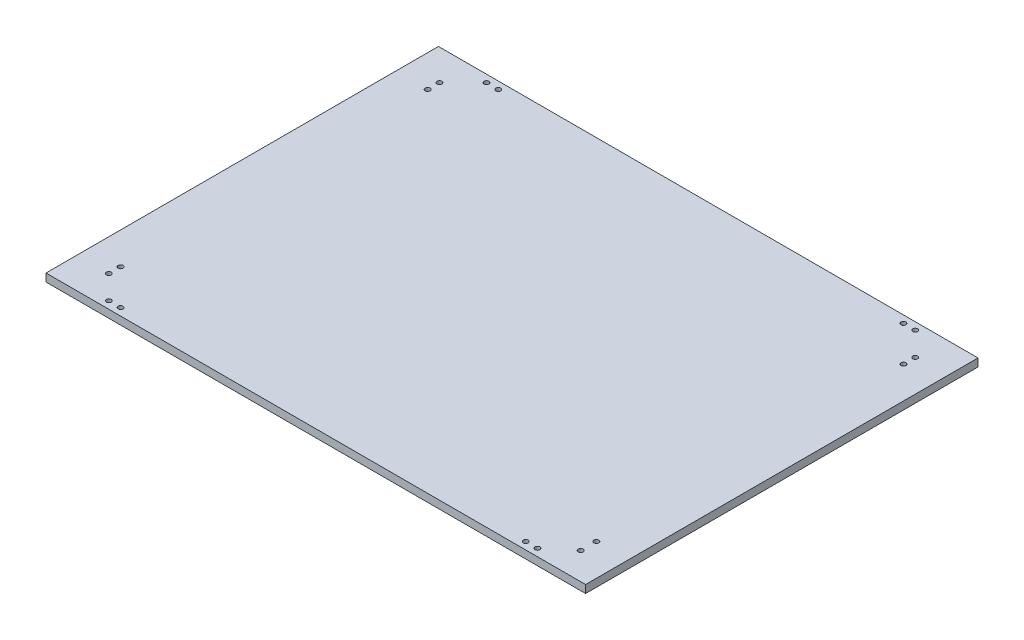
ISO-10303-21;
HEADER;
FILE_DESCRIPTION(('STEP AP214'),'2;1');
FILE_NAME('part.step','',(''),(''),'','','');
FILE_SCHEMA(('AUTOMOTIVE_DESIGN { 1 0 10303 214 1 1 1 1 }'));
ENDSEC;
DATA;
#1=APPLICATION_CONTEXT('core data for automotive mechanical design processes');
#2=APPLICATION_PROTOCOL_DEFINITION('international standard','automotive_design',2000,#1);
#3=PRODUCT_CONTEXT('',#1,'mechanical');
#4=PRODUCT('Part','Part','',(#3));
#5=PRODUCT_RELATED_PRODUCT_CATEGORY('part','',(#4));
#6=PRODUCT_DEFINITION_FORMATION('','',#4);
#7=PRODUCT_DEFINITION_CONTEXT('part definition',#1,'design');
#8=PRODUCT_DEFINITION('design','',#6,#7);
#9=PRODUCT_DEFINITION_SHAPE('','',#8);
#10=(LENGTH_UNIT() NAMED_UNIT(*) SI_UNIT(.MILLI.,.METRE.));
#11=(NAMED_UNIT(*) PLANE_ANGLE_UNIT() SI_UNIT($,.RADIAN.));
#12=(NAMED_UNIT(*) SI_UNIT($,.STERADIAN.) SOLID_ANGLE_UNIT());
#13=UNCERTAINTY_MEASURE_WITH_UNIT(LENGTH_MEASURE(1.E-05),#10,'distance_accuracy_value','');
#14=(GEOMETRIC_REPRESENTATION_CONTEXT(3) GLOBAL_UNCERTAINTY_ASSIGNED_CONTEXT((#13)) GLOBAL_UNIT_ASSIGNED_CONTEXT((#10,
#11,#12)) REPRESENTATION_CONTEXT('',''));
#15=CARTESIAN_POINT('',(0.,0.,0.));
#16=DIRECTION('',(0.,0.,1.));
#17=DIRECTION('',(1.,0.,0.));
#18=AXIS2_PLACEMENT_3D('',#15,#16,#17);
#19=CARTESIAN_POINT('',(0.,16.,0.));
#20=DIRECTION('',(1.,0.,0.));
#21=DIRECTION('',(0.,0.,-1.));
#22=AXIS2_PLACEMENT_3D('',#19,#20,#21);
#23=PLANE('',#22);
#24=DIRECTION('',(0.,0.,1.));
#25=VECTOR('',#24,1.);
#26=CARTESIAN_POINT('',(0.,0.,0.));
#27=LINE('',#26,#25);
#28=CARTESIAN_POINT('',(-1.9593701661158E-13,0.,-800.));
#29=VERTEX_POINT('',#28);
#30=CARTESIAN_POINT('',(0.,0.,0.));
#31=VERTEX_POINT('',#30);
#32=EDGE_CURVE('E70',#29,#31,#27,.T.);
#33=ORIENTED_EDGE('',*,*,#32,.T.);
#34=DIRECTION('',(0.,-1.,0.));
#35=VECTOR('',#34,1.);
#36=CARTESIAN_POINT('',(0.,16.,0.));
#37=LINE('',#36,#35);
#38=CARTESIAN_POINT('',(0.,16.,0.));
#39=VERTEX_POINT('',#38);
#40=EDGE_CURVE('E11',#39,#31,#37,.T.);
#41=ORIENTED_EDGE('',*,*,#40,.F.);
#42=DIRECTION('',(0.,0.,1.));
#43=VECTOR('',#42,1.);
#44=CARTESIAN_POINT('',(0.,16.,0.));
#45=LINE('',#44,#43);
#46=CARTESIAN_POINT('',(-1.9593701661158E-13,16.,-800.));
#47=VERTEX_POINT('',#46);
#48=EDGE_CURVE('E93',#47,#39,#45,.T.);
#49=ORIENTED_EDGE('',*,*,#48,.F.);
#50=DIRECTION('',(0.,-1.,0.));
#51=VECTOR('',#50,1.);
#52=CARTESIAN_POINT('',(-1.9593701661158E-13,16.,-800.));
#53=LINE('',#52,#51);
#54=EDGE_CURVE('E82',#47,#29,#53,.T.);
#55=ORIENTED_EDGE('',*,*,#54,.T.);
#56=EDGE_LOOP('',(#33,#41,#49,#55));
#57=FACE_BOUND('',#56,.T.);
#58=ADVANCED_FACE('F26',(#57),#23,.F.);
#59=CARTESIAN_POINT('',(0.,16.,0.));
#60=DIRECTION('',(0.,0.,-1.));
#61=DIRECTION('',(-1.,0.,0.));
#62=AXIS2_PLACEMENT_3D('',#59,#60,#61);
#63=PLANE('',#62);
#64=DIRECTION('',(1.,0.,0.));
#65=VECTOR('',#64,1.);
#66=CARTESIAN_POINT('',(0.,0.,0.));
#67=LINE('',#66,#65);
#68=CARTESIAN_POINT('',(1100.,0.,0.));
#69=VERTEX_POINT('',#68);
#70=EDGE_CURVE('E66',#31,#69,#67,.T.);
#71=ORIENTED_EDGE('',*,*,#70,.T.);
#72=DIRECTION('',(0.,-1.,0.));
#73=VECTOR('',#72,1.);
#74=CARTESIAN_POINT('',(1100.,16.,0.));
#75=LINE('',#74,#73);
#76=CARTESIAN_POINT('',(1100.,16.,0.));
#77=VERTEX_POINT('',#76);
#78=EDGE_CURVE('E33',#77,#69,#75,.T.);
#79=ORIENTED_EDGE('',*,*,#78,.F.);
#80=DIRECTION('',(1.,0.,0.));
#81=VECTOR('',#80,1.);
#82=CARTESIAN_POINT('',(0.,16.,0.));
#83=LINE('',#82,#81);
#84=EDGE_CURVE('E78',#39,#77,#83,.T.);
#85=ORIENTED_EDGE('',*,*,#84,.F.);
#86=ORIENTED_EDGE('',*,*,#40,.T.);
#87=EDGE_LOOP('',(#71,#79,#85,#86));
#88=FACE_BOUND('',#87,.T.);
#89=ADVANCED_FACE('F77',(#88),#63,.F.);
#90=CARTESIAN_POINT('',(1100.,16.,0.));
#91=DIRECTION('',(-1.,0.,0.));
#92=DIRECTION('',(0.,0.,1.));
#93=AXIS2_PLACEMENT_3D('',#90,#91,#92);
#94=PLANE('',#93);
#95=DIRECTION('',(0.,0.,-1.));
#96=VECTOR('',#95,1.);
#97=CARTESIAN_POINT('',(1100.,0.,0.));
#98=LINE('',#97,#96);
#99=CARTESIAN_POINT('',(1100.,0.,-800.));
#100=VERTEX_POINT('',#99);
#101=EDGE_CURVE('E71',#69,#100,#98,.T.);
#102=ORIENTED_EDGE('',*,*,#101,.T.);
#103=DIRECTION('',(0.,-1.,0.));
#104=VECTOR('',#103,1.);
#105=CARTESIAN_POINT('',(1100.,16.,-800.));
#106=LINE('',#105,#104);
#107=CARTESIAN_POINT('',(1100.,16.,-800.));
#108=VERTEX_POINT('',#107);
#109=EDGE_CURVE('E99',#108,#100,#106,.T.);
#110=ORIENTED_EDGE('',*,*,#109,.F.);
#111=DIRECTION('',(0.,0.,-1.));
#112=VECTOR('',#111,1.);
#113=CARTESIAN_POINT('',(1100.,16.,0.));
#114=LINE('',#113,#112);
#115=EDGE_CURVE('E45',#77,#108,#114,.T.);
#116=ORIENTED_EDGE('',*,*,#115,.F.);
#117=ORIENTED_EDGE('',*,*,#78,.T.);
#118=EDGE_LOOP('',(#102,#110,#116,#117));
#119=FACE_BOUND('',#118,.T.);
#120=ADVANCED_FACE('F102',(#119),#94,.F.);
#121=CARTESIAN_POINT('',(-1.9593701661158E-13,16.,-800.));
#122=DIRECTION('',(0.,0.,1.));
#123=DIRECTION('',(1.,0.,0.));
#124=AXIS2_PLACEMENT_3D('',#121,#122,#123);
#125=PLANE('',#124);
#126=DIRECTION('',(-1.,0.,0.));
#127=VECTOR('',#126,1.);
#128=CARTESIAN_POINT('',(-1.9593701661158E-13,0.,-800.));
#129=LINE('',#128,#127);
#130=EDGE_CURVE('E91',#100,#29,#129,.T.);
#131=ORIENTED_EDGE('',*,*,#130,.T.);
#132=ORIENTED_EDGE('',*,*,#54,.F.);
#133=DIRECTION('',(-1.,0.,0.));
#134=VECTOR('',#133,1.);
#135=CARTESIAN_POINT('',(-1.9593701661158E-13,16.,-800.));
#136=LINE('',#135,#134);
#137=EDGE_CURVE('E40',#108,#47,#136,.T.);
#138=ORIENTED_EDGE('',*,*,#137,.F.);
#139=ORIENTED_EDGE('',*,*,#109,.T.);
#140=EDGE_LOOP('',(#131,#132,#138,#139));
#141=FACE_BOUND('',#140,.T.);
#142=ADVANCED_FACE('F104',(#141),#125,.F.);
#143=CARTESIAN_POINT('',(-1.9593701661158E-13,16.,-800.));
#144=DIRECTION('',(0.,-1.,0.));
#145=DIRECTION('',(0.,0.,-1.));
#146=AXIS2_PLACEMENT_3D('',#143,#144,#145);
#147=PLANE('',#146);
#148=CARTESIAN_POINT('',(987.,16.,-785.));
#149=DIRECTION('',(0.,1.,0.));
#150=DIRECTION('',(0.,0.,-1.));
#151=AXIS2_PLACEMENT_3D('',#148,#149,#150);
#152=CIRCLE('',#151,5.00000000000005);
#153=CARTESIAN_POINT('',(987.,16.,-790.));
#154=VERTEX_POINT('',#153);
#155=EDGE_CURVE('E273',#154,#154,#152,.T.);
#156=ORIENTED_EDGE('',*,*,#155,.F.);
#157=EDGE_LOOP('',(#156));
#158=FACE_BOUND('',#157,.T.);
#159=CARTESIAN_POINT('',(64.9999999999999,16.,-87.));
#160=DIRECTION('',(0.,1.,0.));
#161=DIRECTION('',(0.,0.,1.));
#162=AXIS2_PLACEMENT_3D('',#159,#160,#161);
#163=CIRCLE('',#162,5.00000000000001);
#164=CARTESIAN_POINT('',(64.9999999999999,16.,-82.));
#165=VERTEX_POINT('',#164);
#166=EDGE_CURVE('E275',#165,#165,#163,.T.);
#167=ORIENTED_EDGE('',*,*,#166,.F.);
#168=EDGE_LOOP('',(#167));
#169=FACE_BOUND('',#168,.T.);
#170=CARTESIAN_POINT('',(963.,16.,-785.));
#171=DIRECTION('',(0.,1.,0.));
#172=DIRECTION('',(0.,0.,1.));
#173=AXIS2_PLACEMENT_3D('',#170,#171,#172);
#174=CIRCLE('',#173,4.99999999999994);
#175=CARTESIAN_POINT('',(963.,16.,-780.));
#176=VERTEX_POINT('',#175);
#177=EDGE_CURVE('E283',#176,#176,#174,.T.);
#178=ORIENTED_EDGE('',*,*,#177,.F.);
#179=EDGE_LOOP('',(#178));
#180=FACE_BOUND('',#179,.T.);
#181=CARTESIAN_POINT('',(963.,16.,-15.));
#182=DIRECTION('',(0.,1.,0.));
#183=DIRECTION('',(0.,0.,-1.));
#184=AXIS2_PLACEMENT_3D('',#181,#182,#183);
#185=CIRCLE('',#184,5.00000000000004);
#186=CARTESIAN_POINT('',(963.,16.,-20.0000000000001));
#187=VERTEX_POINT('',#186);
#188=EDGE_CURVE('E289',#187,#187,#185,.T.);
#189=ORIENTED_EDGE('',*,*,#188,.F.);
#190=EDGE_LOOP('',(#189));
#191=FACE_BOUND('',#190,.T.);
#192=CARTESIAN_POINT('',(987.,16.,-15.));
#193=DIRECTION('',(0.,1.,0.));
#194=DIRECTION('',(0.,0.,1.));
#195=AXIS2_PLACEMENT_3D('',#192,#193,#194);
#196=CIRCLE('',#195,4.99999999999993);
#197=CARTESIAN_POINT('',(987.,16.,-10.0000000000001));
#198=VERTEX_POINT('',#197);
#199=EDGE_CURVE('E295',#198,#198,#196,.T.);
#200=ORIENTED_EDGE('',*,*,#199,.F.);
#201=EDGE_LOOP('',(#200));
#202=FACE_BOUND('',#201,.T.);
#203=CARTESIAN_POINT('',(113.,16.,-15.));
#204=DIRECTION('',(0.,1.,0.));
#205=DIRECTION('',(0.,0.,-1.));
#206=AXIS2_PLACEMENT_3D('',#203,#204,#205);
#207=CIRCLE('',#206,4.99999999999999);
#208=CARTESIAN_POINT('',(113.,16.,-20.));
#209=VERTEX_POINT('',#208);
#210=EDGE_CURVE('E301',#209,#209,#207,.T.);
#211=ORIENTED_EDGE('',*,*,#210,.F.);
#212=EDGE_LOOP('',(#211));
#213=FACE_BOUND('',#212,.T.);
#214=CARTESIAN_POINT('',(64.9999999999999,16.,-63.0000000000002));
#215=DIRECTION('',(0.,1.,0.));
#216=DIRECTION('',(0.,0.,-1.));
#217=AXIS2_PLACEMENT_3D('',#214,#215,#216);
#218=CIRCLE('',#217,5.00000000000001);
#219=CARTESIAN_POINT('',(64.9999999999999,16.,-68.0000000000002));
#220=VERTEX_POINT('',#219);
#221=EDGE_CURVE('E307',#220,#220,#218,.T.);
#222=ORIENTED_EDGE('',*,*,#221,.F.);
#223=EDGE_LOOP('',(#222));
#224=FACE_BOUND('',#223,.T.);
#225=CARTESIAN_POINT('',(137.,16.,-15.));
#226=DIRECTION('',(0.,1.,0.));
#227=DIRECTION('',(0.,0.,1.));
#228=AXIS2_PLACEMENT_3D('',#225,#226,#227);
#229=CIRCLE('',#228,5.00000000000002);
#230=CARTESIAN_POINT('',(137.,16.,-9.99999999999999));
#231=VERTEX_POINT('',#230);
#232=EDGE_CURVE('E313',#231,#231,#229,.T.);
#233=ORIENTED_EDGE('',*,*,#232,.F.);
#234=EDGE_LOOP('',(#233));
#235=FACE_BOUND('',#234,.T.);
#236=CARTESIAN_POINT('',(64.9999999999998,16.,-737.));
#237=DIRECTION('',(0.,1.,0.));
#238=DIRECTION('',(0.,0.,1.));
#239=AXIS2_PLACEMENT_3D('',#236,#237,#238);
#240=CIRCLE('',#239,5.00000000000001);
#241=CARTESIAN_POINT('',(64.9999999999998,16.,-732.));
#242=VERTEX_POINT('',#241);
#243=EDGE_CURVE('E319',#242,#242,#240,.T.);
#244=ORIENTED_EDGE('',*,*,#243,.F.);
#245=EDGE_LOOP('',(#244));
#246=FACE_BOUND('',#245,.T.);
#247=CARTESIAN_POINT('',(137.,16.,-785.));
#248=DIRECTION('',(0.,1.,0.));
#249=DIRECTION('',(0.,0.,-1.));
#250=AXIS2_PLACEMENT_3D('',#247,#248,#249);
#251=CIRCLE('',#250,4.99999999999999);
#252=CARTESIAN_POINT('',(137.,16.,-790.));
#253=VERTEX_POINT('',#252);
#254=EDGE_CURVE('E325',#253,#253,#251,.T.);
#255=ORIENTED_EDGE('',*,*,#254,.F.);
#256=EDGE_LOOP('',(#255));
#257=FACE_BOUND('',#256,.T.);
#258=CARTESIAN_POINT('',(1035.,16.,-713.));
#259=DIRECTION('',(0.,1.,0.));
#260=DIRECTION('',(0.,0.,1.));
#261=AXIS2_PLACEMENT_3D('',#258,#259,#260);
#262=CIRCLE('',#261,5.00000000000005);
#263=CARTESIAN_POINT('',(1035.,16.,-708.));
#264=VERTEX_POINT('',#263);
#265=EDGE_CURVE('E331',#264,#264,#262,.T.);
#266=ORIENTED_EDGE('',*,*,#265,.F.);
#267=EDGE_LOOP('',(#266));
#268=FACE_BOUND('',#267,.T.);
#269=CARTESIAN_POINT('',(1035.,16.,-737.));
#270=DIRECTION('',(0.,1.,0.));
#271=DIRECTION('',(0.,0.,-1.));
#272=AXIS2_PLACEMENT_3D('',#269,#270,#271);
#273=CIRCLE('',#272,5.00000000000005);
#274=CARTESIAN_POINT('',(1035.,16.,-742.));
#275=VERTEX_POINT('',#274);
#276=EDGE_CURVE('E337',#275,#275,#273,.T.);
#277=ORIENTED_EDGE('',*,*,#276,.F.);
#278=EDGE_LOOP('',(#277));
#279=FACE_BOUND('',#278,.T.);
#280=CARTESIAN_POINT('',(1035.,16.,-54.9999999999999));
#281=DIRECTION('',(0.,1.,0.));
#282=DIRECTION('',(0.,0.,1.));
#283=AXIS2_PLACEMENT_3D('',#280,#281,#282);
#284=CIRCLE('',#283,5.00000000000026);
#285=CARTESIAN_POINT('',(1035.,16.,-49.9999999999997));
#286=VERTEX_POINT('',#285);
#287=EDGE_CURVE('E343',#286,#286,#284,.T.);
#288=ORIENTED_EDGE('',*,*,#287,.F.);
#289=EDGE_LOOP('',(#288));
#290=FACE_BOUND('',#289,.T.);
#291=CARTESIAN_POINT('',(1035.,16.,-87.));
#292=DIRECTION('',(0.,1.,0.));
#293=DIRECTION('',(0.,0.,-1.));
#294=AXIS2_PLACEMENT_3D('',#291,#292,#293);
#295=CIRCLE('',#294,5.00000000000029);
#296=CARTESIAN_POINT('',(1035.,16.,-92.0000000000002));
#297=VERTEX_POINT('',#296);
#298=EDGE_CURVE('E349',#297,#297,#295,.T.);
#299=ORIENTED_EDGE('',*,*,#298,.F.);
#300=EDGE_LOOP('',(#299));
#301=FACE_BOUND('',#300,.T.);
#302=CARTESIAN_POINT('',(64.9999999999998,16.,-713.));
#303=DIRECTION('',(0.,1.,0.));
#304=DIRECTION('',(0.,0.,-1.));
#305=AXIS2_PLACEMENT_3D('',#302,#303,#304);
#306=CIRCLE('',#305,5.00000000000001);
#307=CARTESIAN_POINT('',(64.9999999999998,16.,-718.));
#308=VERTEX_POINT('',#307);
#309=EDGE_CURVE('E355',#308,#308,#306,.T.);
#310=ORIENTED_EDGE('',*,*,#309,.F.);
#311=EDGE_LOOP('',(#310));
#312=FACE_BOUND('',#311,.T.);
#313=CARTESIAN_POINT('',(113.,16.,-785.));
#314=DIRECTION('',(0.,1.,0.));
#315=DIRECTION('',(0.,0.,1.));
#316=AXIS2_PLACEMENT_3D('',#313,#314,#315);
#317=CIRCLE('',#316,4.99999999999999);
#318=CARTESIAN_POINT('',(113.,16.,-780.));
#319=VERTEX_POINT('',#318);
#320=EDGE_CURVE('E86',#319,#319,#317,.T.);
#321=ORIENTED_EDGE('',*,*,#320,.F.);
#322=EDGE_LOOP('',(#321));
#323=FACE_BOUND('',#322,.T.);
#324=ORIENTED_EDGE('',*,*,#48,.T.);
#325=ORIENTED_EDGE('',*,*,#84,.T.);
#326=ORIENTED_EDGE('',*,*,#115,.T.);
#327=ORIENTED_EDGE('',*,*,#137,.T.);
#328=EDGE_LOOP('',(#324,#325,#326,#327));
#329=FACE_BOUND('',#328,.T.);
#330=ADVANCED_FACE('F105',(#158,#169,#180,#191,#202,#213,#224,#235,#246,#257,#268,#279,#290,
#301,#312,#323,#329),#147,.F.);
#331=CARTESIAN_POINT('',(-1.9593701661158E-13,0.,-800.));
#332=DIRECTION('',(0.,-1.,0.));
#333=DIRECTION('',(0.,0.,-1.));
#334=AXIS2_PLACEMENT_3D('',#331,#332,#333);
#335=PLANE('',#334);
#336=CARTESIAN_POINT('',(987.,0.,-785.));
#337=DIRECTION('',(0.,1.,0.));
#338=DIRECTION('',(0.,0.,-1.));
#339=AXIS2_PLACEMENT_3D('',#336,#337,#338);
#340=CIRCLE('',#339,5.00000000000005);
#341=CARTESIAN_POINT('',(987.,0.,-790.));
#342=VERTEX_POINT('',#341);
#343=EDGE_CURVE('E271',#342,#342,#340,.T.);
#344=ORIENTED_EDGE('',*,*,#343,.T.);
#345=EDGE_LOOP('',(#344));
#346=FACE_BOUND('',#345,.T.);
#347=CARTESIAN_POINT('',(64.9999999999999,0.,-87.));
#348=DIRECTION('',(0.,1.,0.));
#349=DIRECTION('',(0.,0.,1.));
#350=AXIS2_PLACEMENT_3D('',#347,#348,#349);
#351=CIRCLE('',#350,5.00000000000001);
#352=CARTESIAN_POINT('',(64.9999999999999,0.,-82.));
#353=VERTEX_POINT('',#352);
#354=EDGE_CURVE('E280',#353,#353,#351,.T.);
#355=ORIENTED_EDGE('',*,*,#354,.T.);
#356=EDGE_LOOP('',(#355));
#357=FACE_BOUND('',#356,.T.);
#358=CARTESIAN_POINT('',(963.,0.,-785.));
#359=DIRECTION('',(0.,1.,0.));
#360=DIRECTION('',(0.,0.,1.));
#361=AXIS2_PLACEMENT_3D('',#358,#359,#360);
#362=CIRCLE('',#361,4.99999999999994);
#363=CARTESIAN_POINT('',(963.,0.,-780.));
#364=VERTEX_POINT('',#363);
#365=EDGE_CURVE('E286',#364,#364,#362,.T.);
#366=ORIENTED_EDGE('',*,*,#365,.T.);
#367=EDGE_LOOP('',(#366));
#368=FACE_BOUND('',#367,.T.);
#369=CARTESIAN_POINT('',(963.,0.,-15.));
#370=DIRECTION('',(0.,1.,0.));
#371=DIRECTION('',(0.,0.,-1.));
#372=AXIS2_PLACEMENT_3D('',#369,#370,#371);
#373=CIRCLE('',#372,5.00000000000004);
#374=CARTESIAN_POINT('',(963.,0.,-20.0000000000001));
#375=VERTEX_POINT('',#374);
#376=EDGE_CURVE('E292',#375,#375,#373,.T.);
#377=ORIENTED_EDGE('',*,*,#376,.T.);
#378=EDGE_LOOP('',(#377));
#379=FACE_BOUND('',#378,.T.);
#380=CARTESIAN_POINT('',(987.,0.,-15.));
#381=DIRECTION('',(0.,1.,0.));
#382=DIRECTION('',(0.,0.,1.));
#383=AXIS2_PLACEMENT_3D('',#380,#381,#382);
#384=CIRCLE('',#383,4.99999999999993);
#385=CARTESIAN_POINT('',(987.,0.,-10.0000000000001));
#386=VERTEX_POINT('',#385);
#387=EDGE_CURVE('E298',#386,#386,#384,.T.);
#388=ORIENTED_EDGE('',*,*,#387,.T.);
#389=EDGE_LOOP('',(#388));
#390=FACE_BOUND('',#389,.T.);
#391=CARTESIAN_POINT('',(113.,0.,-15.));
#392=DIRECTION('',(0.,1.,0.));
#393=DIRECTION('',(0.,0.,-1.));
#394=AXIS2_PLACEMENT_3D('',#391,#392,#393);
#395=CIRCLE('',#394,4.99999999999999);
#396=CARTESIAN_POINT('',(113.,0.,-20.));
#397=VERTEX_POINT('',#396);
#398=EDGE_CURVE('E304',#397,#397,#395,.T.);
#399=ORIENTED_EDGE('',*,*,#398,.T.);
#400=EDGE_LOOP('',(#399));
#401=FACE_BOUND('',#400,.T.);
#402=CARTESIAN_POINT('',(64.9999999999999,0.,-63.0000000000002));
#403=DIRECTION('',(0.,1.,0.));
#404=DIRECTION('',(0.,0.,-1.));
#405=AXIS2_PLACEMENT_3D('',#402,#403,#404);
#406=CIRCLE('',#405,5.00000000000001);
#407=CARTESIAN_POINT('',(64.9999999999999,0.,-68.0000000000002));
#408=VERTEX_POINT('',#407);
#409=EDGE_CURVE('E310',#408,#408,#406,.T.);
#410=ORIENTED_EDGE('',*,*,#409,.T.);
#411=EDGE_LOOP('',(#410));
#412=FACE_BOUND('',#411,.T.);
#413=CARTESIAN_POINT('',(137.,0.,-15.));
#414=DIRECTION('',(0.,1.,0.));
#415=DIRECTION('',(0.,0.,1.));
#416=AXIS2_PLACEMENT_3D('',#413,#414,#415);
#417=CIRCLE('',#416,5.00000000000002);
#418=CARTESIAN_POINT('',(137.,0.,-9.99999999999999));
#419=VERTEX_POINT('',#418);
#420=EDGE_CURVE('E316',#419,#419,#417,.T.);
#421=ORIENTED_EDGE('',*,*,#420,.T.);
#422=EDGE_LOOP('',(#421));
#423=FACE_BOUND('',#422,.T.);
#424=CARTESIAN_POINT('',(64.9999999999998,0.,-737.));
#425=DIRECTION('',(0.,1.,0.));
#426=DIRECTION('',(0.,0.,1.));
#427=AXIS2_PLACEMENT_3D('',#424,#425,#426);
#428=CIRCLE('',#427,5.00000000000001);
#429=CARTESIAN_POINT('',(64.9999999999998,0.,-732.));
#430=VERTEX_POINT('',#429);
#431=EDGE_CURVE('E322',#430,#430,#428,.T.);
#432=ORIENTED_EDGE('',*,*,#431,.T.);
#433=EDGE_LOOP('',(#432));
#434=FACE_BOUND('',#433,.T.);
#435=CARTESIAN_POINT('',(137.,0.,-785.));
#436=DIRECTION('',(0.,1.,0.));
#437=DIRECTION('',(0.,0.,-1.));
#438=AXIS2_PLACEMENT_3D('',#435,#436,#437);
#439=CIRCLE('',#438,4.99999999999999);
#440=CARTESIAN_POINT('',(137.,0.,-790.));
#441=VERTEX_POINT('',#440);
#442=EDGE_CURVE('E328',#441,#441,#439,.T.);
#443=ORIENTED_EDGE('',*,*,#442,.T.);
#444=EDGE_LOOP('',(#443));
#445=FACE_BOUND('',#444,.T.);
#446=CARTESIAN_POINT('',(1035.,0.,-713.));
#447=DIRECTION('',(0.,1.,0.));
#448=DIRECTION('',(0.,0.,1.));
#449=AXIS2_PLACEMENT_3D('',#446,#447,#448);
#450=CIRCLE('',#449,5.00000000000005);
#451=CARTESIAN_POINT('',(1035.,0.,-708.));
#452=VERTEX_POINT('',#451);
#453=EDGE_CURVE('E334',#452,#452,#450,.T.);
#454=ORIENTED_EDGE('',*,*,#453,.T.);
#455=EDGE_LOOP('',(#454));
#456=FACE_BOUND('',#455,.T.);
#457=CARTESIAN_POINT('',(1035.,0.,-737.));
#458=DIRECTION('',(0.,1.,0.));
#459=DIRECTION('',(0.,0.,-1.));
#460=AXIS2_PLACEMENT_3D('',#457,#458,#459);
#461=CIRCLE('',#460,5.00000000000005);
#462=CARTESIAN_POINT('',(1035.,0.,-742.));
#463=VERTEX_POINT('',#462);
#464=EDGE_CURVE('E340',#463,#463,#461,.T.);
#465=ORIENTED_EDGE('',*,*,#464,.T.);
#466=EDGE_LOOP('',(#465));
#467=FACE_BOUND('',#466,.T.);
#468=CARTESIAN_POINT('',(1035.,0.,-54.9999999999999));
#469=DIRECTION('',(0.,1.,0.));
#470=DIRECTION('',(0.,0.,1.));
#471=AXIS2_PLACEMENT_3D('',#468,#469,#470);
#472=CIRCLE('',#471,5.00000000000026);
#473=CARTESIAN_POINT('',(1035.,0.,-49.9999999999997));
#474=VERTEX_POINT('',#473);
#475=EDGE_CURVE('E346',#474,#474,#472,.T.);
#476=ORIENTED_EDGE('',*,*,#475,.T.);
#477=EDGE_LOOP('',(#476));
#478=FACE_BOUND('',#477,.T.);
#479=CARTESIAN_POINT('',(1035.,0.,-87.));
#480=DIRECTION('',(0.,1.,0.));
#481=DIRECTION('',(0.,0.,-1.));
#482=AXIS2_PLACEMENT_3D('',#479,#480,#481);
#483=CIRCLE('',#482,5.00000000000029);
#484=CARTESIAN_POINT('',(1035.,0.,-92.0000000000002));
#485=VERTEX_POINT('',#484);
#486=EDGE_CURVE('E352',#485,#485,#483,.T.);
#487=ORIENTED_EDGE('',*,*,#486,.T.);
#488=EDGE_LOOP('',(#487));
#489=FACE_BOUND('',#488,.T.);
#490=CARTESIAN_POINT('',(64.9999999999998,0.,-713.));
#491=DIRECTION('',(0.,1.,0.));
#492=DIRECTION('',(0.,0.,-1.));
#493=AXIS2_PLACEMENT_3D('',#490,#491,#492);
#494=CIRCLE('',#493,5.00000000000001);
#495=CARTESIAN_POINT('',(64.9999999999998,0.,-718.));
#496=VERTEX_POINT('',#495);
#497=EDGE_CURVE('E358',#496,#496,#494,.T.);
#498=ORIENTED_EDGE('',*,*,#497,.T.);
#499=EDGE_LOOP('',(#498));
#500=FACE_BOUND('',#499,.T.);
#501=CARTESIAN_POINT('',(113.,0.,-785.));
#502=DIRECTION('',(0.,1.,0.));
#503=DIRECTION('',(0.,0.,1.));
#504=AXIS2_PLACEMENT_3D('',#501,#502,#503);
#505=CIRCLE('',#504,4.99999999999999);
#506=CARTESIAN_POINT('',(113.,0.,-780.));
#507=VERTEX_POINT('',#506);
#508=EDGE_CURVE('E83',#507,#507,#505,.T.);
#509=ORIENTED_EDGE('',*,*,#508,.T.);
#510=EDGE_LOOP('',(#509));
#511=FACE_BOUND('',#510,.T.);
#512=ORIENTED_EDGE('',*,*,#32,.F.);
#513=ORIENTED_EDGE('',*,*,#130,.F.);
#514=ORIENTED_EDGE('',*,*,#101,.F.);
#515=ORIENTED_EDGE('',*,*,#70,.F.);
#516=EDGE_LOOP('',(#512,#513,#514,#515));
#517=FACE_BOUND('',#516,.T.);
#518=ADVANCED_FACE('F67',(#346,#357,#368,#379,#390,#401,#412,#423,#434,#445,#456,#467,#478,#489,
#500,#511,#517),#335,.T.);
#519=CARTESIAN_POINT('',(113.,0.,-785.));
#520=DIRECTION('',(0.,1.,0.));
#521=DIRECTION('',(0.,0.,1.));
#522=AXIS2_PLACEMENT_3D('',#519,#520,#521);
#523=CYLINDRICAL_SURFACE('',#522,4.99999999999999);
#524=ORIENTED_EDGE('',*,*,#508,.F.);
#525=EDGE_LOOP('',(#524));
#526=FACE_BOUND('',#525,.T.);
#527=ORIENTED_EDGE('',*,*,#320,.T.);
#528=EDGE_LOOP('',(#527));
#529=FACE_BOUND('',#528,.T.);
#530=ADVANCED_FACE('F113',(#526,#529),#523,.F.);
#531=CARTESIAN_POINT('',(64.9999999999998,0.,-713.));
#532=DIRECTION('',(0.,1.,0.));
#533=DIRECTION('',(0.,0.,1.));
#534=AXIS2_PLACEMENT_3D('',#531,#532,#533);
#535=CYLINDRICAL_SURFACE('',#534,5.00000000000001);
#536=ORIENTED_EDGE('',*,*,#497,.F.);
#537=EDGE_LOOP('',(#536));
#538=FACE_BOUND('',#537,.T.);
#539=ORIENTED_EDGE('',*,*,#309,.T.);
#540=EDGE_LOOP('',(#539));
#541=FACE_BOUND('',#540,.T.);
#542=ADVANCED_FACE('F146',(#538,#541),#535,.F.);
#543=CARTESIAN_POINT('',(1035.,0.,-87.));
#544=DIRECTION('',(0.,1.,0.));
#545=DIRECTION('',(0.,0.,1.));
#546=AXIS2_PLACEMENT_3D('',#543,#544,#545);
#547=CYLINDRICAL_SURFACE('',#546,5.00000000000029);
#548=ORIENTED_EDGE('',*,*,#486,.F.);
#549=EDGE_LOOP('',(#548));
#550=FACE_BOUND('',#549,.T.);
#551=ORIENTED_EDGE('',*,*,#298,.T.);
#552=EDGE_LOOP('',(#551));
#553=FACE_BOUND('',#552,.T.);
#554=ADVANCED_FACE('F154',(#550,#553),#547,.F.);
#555=CARTESIAN_POINT('',(1035.,0.,-54.9999999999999));
#556=DIRECTION('',(0.,1.,0.));
#557=DIRECTION('',(0.,0.,1.));
#558=AXIS2_PLACEMENT_3D('',#555,#556,#557);
#559=CYLINDRICAL_SURFACE('',#558,5.00000000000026);
#560=ORIENTED_EDGE('',*,*,#475,.F.);
#561=EDGE_LOOP('',(#560));
#562=FACE_BOUND('',#561,.T.);
#563=ORIENTED_EDGE('',*,*,#287,.T.);
#564=EDGE_LOOP('',(#563));
#565=FACE_BOUND('',#564,.T.);
#566=ADVANCED_FACE('F162',(#562,#565),#559,.F.);
#567=CARTESIAN_POINT('',(1035.,0.,-737.));
#568=DIRECTION('',(0.,1.,0.));
#569=DIRECTION('',(0.,0.,1.));
#570=AXIS2_PLACEMENT_3D('',#567,#568,#569);
#571=CYLINDRICAL_SURFACE('',#570,5.00000000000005);
#572=ORIENTED_EDGE('',*,*,#464,.F.);
#573=EDGE_LOOP('',(#572));
#574=FACE_BOUND('',#573,.T.);
#575=ORIENTED_EDGE('',*,*,#276,.T.);
#576=EDGE_LOOP('',(#575));
#577=FACE_BOUND('',#576,.T.);
#578=ADVANCED_FACE('F170',(#574,#577),#571,.F.);
#579=CARTESIAN_POINT('',(1035.,0.,-713.));
#580=DIRECTION('',(0.,1.,0.));
#581=DIRECTION('',(0.,0.,1.));
#582=AXIS2_PLACEMENT_3D('',#579,#580,#581);
#583=CYLINDRICAL_SURFACE('',#582,5.00000000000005);
#584=ORIENTED_EDGE('',*,*,#453,.F.);
#585=EDGE_LOOP('',(#584));
#586=FACE_BOUND('',#585,.T.);
#587=ORIENTED_EDGE('',*,*,#265,.T.);
#588=EDGE_LOOP('',(#587));
#589=FACE_BOUND('',#588,.T.);
#590=ADVANCED_FACE('F178',(#586,#589),#583,.F.);
#591=CARTESIAN_POINT('',(137.,0.,-785.));
#592=DIRECTION('',(0.,1.,0.));
#593=DIRECTION('',(0.,0.,1.));
#594=AXIS2_PLACEMENT_3D('',#591,#592,#593);
#595=CYLINDRICAL_SURFACE('',#594,4.99999999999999);
#596=ORIENTED_EDGE('',*,*,#442,.F.);
#597=EDGE_LOOP('',(#596));
#598=FACE_BOUND('',#597,.T.);
#599=ORIENTED_EDGE('',*,*,#254,.T.);
#600=EDGE_LOOP('',(#599));
#601=FACE_BOUND('',#600,.T.);
#602=ADVANCED_FACE('F186',(#598,#601),#595,.F.);
#603=CARTESIAN_POINT('',(64.9999999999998,0.,-737.));
#604=DIRECTION('',(0.,1.,0.));
#605=DIRECTION('',(0.,0.,1.));
#606=AXIS2_PLACEMENT_3D('',#603,#604,#605);
#607=CYLINDRICAL_SURFACE('',#606,5.00000000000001);
#608=ORIENTED_EDGE('',*,*,#431,.F.);
#609=EDGE_LOOP('',(#608));
#610=FACE_BOUND('',#609,.T.);
#611=ORIENTED_EDGE('',*,*,#243,.T.);
#612=EDGE_LOOP('',(#611));
#613=FACE_BOUND('',#612,.T.);
#614=ADVANCED_FACE('F194',(#610,#613),#607,.F.);
#615=CARTESIAN_POINT('',(137.,0.,-15.));
#616=DIRECTION('',(0.,1.,0.));
#617=DIRECTION('',(0.,0.,1.));
#618=AXIS2_PLACEMENT_3D('',#615,#616,#617);
#619=CYLINDRICAL_SURFACE('',#618,5.00000000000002);
#620=ORIENTED_EDGE('',*,*,#420,.F.);
#621=EDGE_LOOP('',(#620));
#622=FACE_BOUND('',#621,.T.);
#623=ORIENTED_EDGE('',*,*,#232,.T.);
#624=EDGE_LOOP('',(#623));
#625=FACE_BOUND('',#624,.T.);
#626=ADVANCED_FACE('F202',(#622,#625),#619,.F.);
#627=CARTESIAN_POINT('',(64.9999999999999,0.,-63.0000000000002));
#628=DIRECTION('',(0.,1.,0.));
#629=DIRECTION('',(0.,0.,1.));
#630=AXIS2_PLACEMENT_3D('',#627,#628,#629);
#631=CYLINDRICAL_SURFACE('',#630,5.00000000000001);
#632=ORIENTED_EDGE('',*,*,#409,.F.);
#633=EDGE_LOOP('',(#632));
#634=FACE_BOUND('',#633,.T.);
#635=ORIENTED_EDGE('',*,*,#221,.T.);
#636=EDGE_LOOP('',(#635));
#637=FACE_BOUND('',#636,.T.);
#638=ADVANCED_FACE('F210',(#634,#637),#631,.F.);
#639=CARTESIAN_POINT('',(113.,0.,-15.));
#640=DIRECTION('',(0.,1.,0.));
#641=DIRECTION('',(0.,0.,1.));
#642=AXIS2_PLACEMENT_3D('',#639,#640,#641);
#643=CYLINDRICAL_SURFACE('',#642,4.99999999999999);
#644=ORIENTED_EDGE('',*,*,#398,.F.);
#645=EDGE_LOOP('',(#644));
#646=FACE_BOUND('',#645,.T.);
#647=ORIENTED_EDGE('',*,*,#210,.T.);
#648=EDGE_LOOP('',(#647));
#649=FACE_BOUND('',#648,.T.);
#650=ADVANCED_FACE('F218',(#646,#649),#643,.F.);
#651=CARTESIAN_POINT('',(987.,0.,-15.));
#652=DIRECTION('',(0.,1.,0.));
#653=DIRECTION('',(0.,0.,1.));
#654=AXIS2_PLACEMENT_3D('',#651,#652,#653);
#655=CYLINDRICAL_SURFACE('',#654,4.99999999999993);
#656=ORIENTED_EDGE('',*,*,#387,.F.);
#657=EDGE_LOOP('',(#656));
#658=FACE_BOUND('',#657,.T.);
#659=ORIENTED_EDGE('',*,*,#199,.T.);
#660=EDGE_LOOP('',(#659));
#661=FACE_BOUND('',#660,.T.);
#662=ADVANCED_FACE('F226',(#658,#661),#655,.F.);
#663=CARTESIAN_POINT('',(963.,0.,-15.));
#664=DIRECTION('',(0.,1.,0.));
#665=DIRECTION('',(0.,0.,1.));
#666=AXIS2_PLACEMENT_3D('',#663,#664,#665);
#667=CYLINDRICAL_SURFACE('',#666,5.00000000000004);
#668=ORIENTED_EDGE('',*,*,#376,.F.);
#669=EDGE_LOOP('',(#668));
#670=FACE_BOUND('',#669,.T.);
#671=ORIENTED_EDGE('',*,*,#188,.T.);
#672=EDGE_LOOP('',(#671));
#673=FACE_BOUND('',#672,.T.);
#674=ADVANCED_FACE('F234',(#670,#673),#667,.F.);
#675=CARTESIAN_POINT('',(963.,0.,-785.));
#676=DIRECTION('',(0.,1.,0.));
#677=DIRECTION('',(0.,0.,1.));
#678=AXIS2_PLACEMENT_3D('',#675,#676,#677);
#679=CYLINDRICAL_SURFACE('',#678,4.99999999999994);
#680=ORIENTED_EDGE('',*,*,#365,.F.);
#681=EDGE_LOOP('',(#680));
#682=FACE_BOUND('',#681,.T.);
#683=ORIENTED_EDGE('',*,*,#177,.T.);
#684=EDGE_LOOP('',(#683));
#685=FACE_BOUND('',#684,.T.);
#686=ADVANCED_FACE('F242',(#682,#685),#679,.F.);
#687=CARTESIAN_POINT('',(64.9999999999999,0.,-87.));
#688=DIRECTION('',(0.,1.,0.));
#689=DIRECTION('',(0.,0.,1.));
#690=AXIS2_PLACEMENT_3D('',#687,#688,#689);
#691=CYLINDRICAL_SURFACE('',#690,5.00000000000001);
#692=ORIENTED_EDGE('',*,*,#354,.F.);
#693=EDGE_LOOP('',(#692));
#694=FACE_BOUND('',#693,.T.);
#695=ORIENTED_EDGE('',*,*,#166,.T.);
#696=EDGE_LOOP('',(#695));
#697=FACE_BOUND('',#696,.T.);
#698=ADVANCED_FACE('F250',(#694,#697),#691,.F.);
#699=CARTESIAN_POINT('',(987.,0.,-785.));
#700=DIRECTION('',(0.,1.,0.));
#701=DIRECTION('',(0.,0.,1.));
#702=AXIS2_PLACEMENT_3D('',#699,#700,#701);
#703=CYLINDRICAL_SURFACE('',#702,5.00000000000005);
#704=ORIENTED_EDGE('',*,*,#343,.F.);
#705=EDGE_LOOP('',(#704));
#706=FACE_BOUND('',#705,.T.);
#707=ORIENTED_EDGE('',*,*,#155,.T.);
#708=EDGE_LOOP('',(#707));
#709=FACE_BOUND('',#708,.T.);
#710=ADVANCED_FACE('F258',(#706,#709),#703,.F.);
#711=CLOSED_SHELL('',(#58,#89,#120,#142,#330,#518,#530,#542,#554,#566,#578,#590,#602,#614,#626,
#638,#650,#662,#674,#686,#698,#710));
#712=MANIFOLD_SOLID_BREP('B2',#711);
#713=ADVANCED_BREP_SHAPE_REPRESENTATION('',(#18,#712),#14);
#714=SHAPE_DEFINITION_REPRESENTATION(#9,#713);
ENDSEC;
END-ISO-10303-21;
